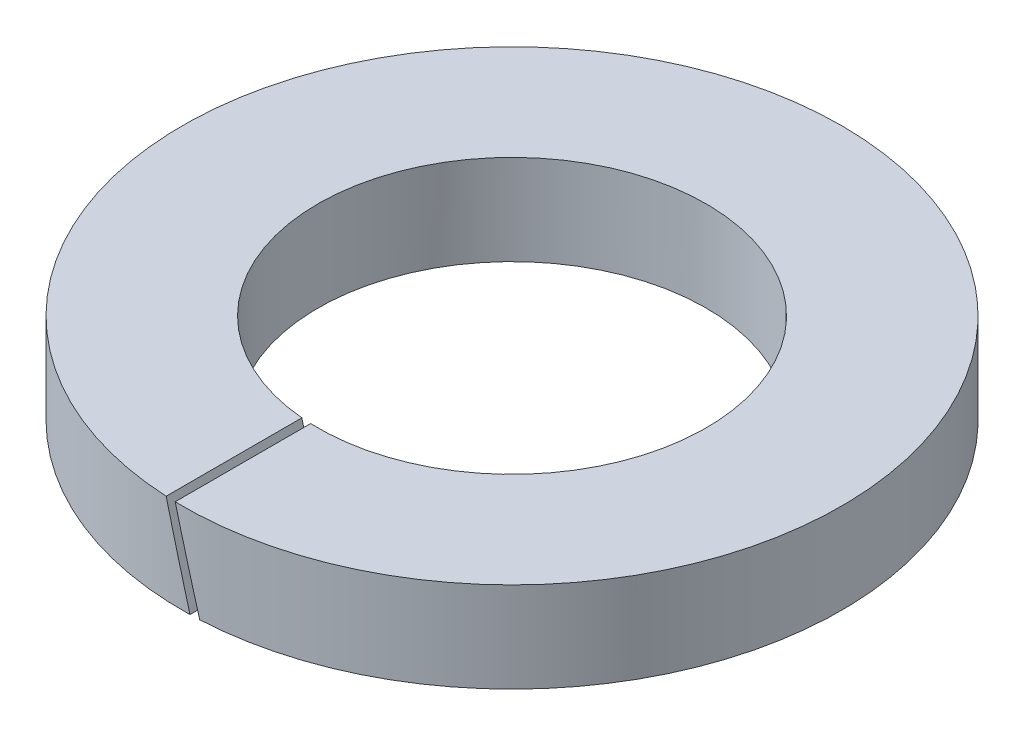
ISO-10303-21;
HEADER;
FILE_DESCRIPTION(('STEP AP214'),'2;1');
FILE_NAME('part.step','',(''),(''),'','','');
FILE_SCHEMA(('AUTOMOTIVE_DESIGN { 1 0 10303 214 1 1 1 1 }'));
ENDSEC;
DATA;
#1=APPLICATION_CONTEXT('core data for automotive mechanical design processes');
#2=APPLICATION_PROTOCOL_DEFINITION('international standard','automotive_design',2000,#1);
#3=PRODUCT_CONTEXT('',#1,'mechanical');
#4=PRODUCT('Part','Part','',(#3));
#5=PRODUCT_RELATED_PRODUCT_CATEGORY('part','',(#4));
#6=PRODUCT_DEFINITION_FORMATION('','',#4);
#7=PRODUCT_DEFINITION_CONTEXT('part definition',#1,'design');
#8=PRODUCT_DEFINITION('design','',#6,#7);
#9=PRODUCT_DEFINITION_SHAPE('','',#8);
#10=(LENGTH_UNIT() NAMED_UNIT(*) SI_UNIT(.MILLI.,.METRE.));
#11=(NAMED_UNIT(*) PLANE_ANGLE_UNIT() SI_UNIT($,.RADIAN.));
#12=(NAMED_UNIT(*) SI_UNIT($,.STERADIAN.) SOLID_ANGLE_UNIT());
#13=UNCERTAINTY_MEASURE_WITH_UNIT(LENGTH_MEASURE(1.E-05),#10,'distance_accuracy_value','');
#14=(GEOMETRIC_REPRESENTATION_CONTEXT(3) GLOBAL_UNCERTAINTY_ASSIGNED_CONTEXT((#13)) GLOBAL_UNIT_ASSIGNED_CONTEXT((#10,
#11,#12)) REPRESENTATION_CONTEXT('',''));
#15=CARTESIAN_POINT('',(0.,0.,0.));
#16=DIRECTION('',(0.,0.,1.));
#17=DIRECTION('',(1.,0.,0.));
#18=AXIS2_PLACEMENT_3D('',#15,#16,#17);
#19=CARTESIAN_POINT('',(0.,0.5,0.));
#20=DIRECTION('',(0.,1.,0.));
#21=DIRECTION('',(0.,0.,1.));
#22=AXIS2_PLACEMENT_3D('',#19,#20,#21);
#23=CYLINDRICAL_SURFACE('',#22,2.15);
#24=CARTESIAN_POINT('',(0.,0.693185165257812,0.));
#25=DIRECTION('',(-0.965925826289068,-0.258819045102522,0.));
#26=DIRECTION('',(-0.258819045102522,0.965925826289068,0.));
#27=AXIS2_PLACEMENT_3D('',#24,#25,#26);
#28=ELLIPSE('',#27,8.30696210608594,2.15);
#29=CARTESIAN_POINT('',(0.185738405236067,0.,2.14196200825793));
#30=VERTEX_POINT('',#29);
#31=CARTESIAN_POINT('',(-0.0822107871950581,1.,2.14842765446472));
#32=VERTEX_POINT('',#31);
#33=EDGE_CURVE('E47',#30,#32,#28,.T.);
#34=ORIENTED_EDGE('',*,*,#33,.T.);
#35=CARTESIAN_POINT('',(0.,1.,0.));
#36=DIRECTION('',(0.,1.,0.));
#37=DIRECTION('',(0.,0.,1.));
#38=AXIS2_PLACEMENT_3D('',#35,#36,#37);
#39=CIRCLE('',#38,2.15);
#40=CARTESIAN_POINT('',(-0.185738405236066,1.,2.14196200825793));
#41=VERTEX_POINT('',#40);
#42=EDGE_CURVE('E11',#32,#41,#39,.T.);
#43=ORIENTED_EDGE('',*,*,#42,.T.);
#44=CARTESIAN_POINT('',(0.,0.306814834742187,0.));
#45=DIRECTION('',(-0.965925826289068,-0.258819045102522,0.));
#46=DIRECTION('',(-0.258819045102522,0.965925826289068,0.));
#47=AXIS2_PLACEMENT_3D('',#44,#45,#46);
#48=ELLIPSE('',#47,8.30696210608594,2.15);
#49=CARTESIAN_POINT('',(0.0822107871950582,0.,2.14842765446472));
#50=VERTEX_POINT('',#49);
#51=EDGE_CURVE('E96',#50,#41,#48,.T.);
#52=ORIENTED_EDGE('',*,*,#51,.F.);
#53=CARTESIAN_POINT('',(0.,0.,0.));
#54=DIRECTION('',(0.,1.,0.));
#55=DIRECTION('',(0.,0.,1.));
#56=AXIS2_PLACEMENT_3D('',#53,#54,#55);
#57=CIRCLE('',#56,2.15);
#58=EDGE_CURVE('E89',#30,#50,#57,.T.);
#59=ORIENTED_EDGE('',*,*,#58,.F.);
#60=EDGE_LOOP('',(#34,#43,#52,#59));
#61=FACE_BOUND('',#60,.T.);
#62=ADVANCED_FACE('F33',(#61),#23,.F.);
#63=CARTESIAN_POINT('',(2.15,1.,0.));
#64=DIRECTION('',(0.,-1.,0.));
#65=DIRECTION('',(0.,0.,-1.));
#66=AXIS2_PLACEMENT_3D('',#63,#64,#65);
#67=PLANE('',#66);
#68=DIRECTION('',(0.,0.,1.));
#69=VECTOR('',#68,1.);
#70=CARTESIAN_POINT('',(-0.0822107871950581,1.,-3.651));
#71=LINE('',#70,#69);
#72=CARTESIAN_POINT('',(-0.0822107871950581,1.,3.64907404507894));
#73=VERTEX_POINT('',#72);
#74=EDGE_CURVE('E74',#32,#73,#71,.T.);
#75=ORIENTED_EDGE('',*,*,#74,.T.);
#76=CARTESIAN_POINT('',(0.,1.,0.));
#77=DIRECTION('',(0.,1.,0.));
#78=DIRECTION('',(0.,0.,1.));
#79=AXIS2_PLACEMENT_3D('',#76,#77,#78);
#80=CIRCLE('',#79,3.65);
#81=CARTESIAN_POINT('',(-0.185738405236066,1.,3.64527107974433));
#82=VERTEX_POINT('',#81);
#83=EDGE_CURVE('E40',#73,#82,#80,.T.);
#84=ORIENTED_EDGE('',*,*,#83,.T.);
#85=DIRECTION('',(0.,0.,1.));
#86=VECTOR('',#85,1.);
#87=CARTESIAN_POINT('',(-0.185738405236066,1.,-3.651));
#88=LINE('',#87,#86);
#89=EDGE_CURVE('E98',#41,#82,#88,.T.);
#90=ORIENTED_EDGE('',*,*,#89,.F.);
#91=ORIENTED_EDGE('',*,*,#42,.F.);
#92=EDGE_LOOP('',(#75,#84,#90,#91));
#93=FACE_BOUND('',#92,.T.);
#94=ADVANCED_FACE('F84',(#93),#67,.F.);
#95=CARTESIAN_POINT('',(0.,0.5,0.));
#96=DIRECTION('',(0.,1.,0.));
#97=DIRECTION('',(0.,0.,1.));
#98=AXIS2_PLACEMENT_3D('',#95,#96,#97);
#99=CYLINDRICAL_SURFACE('',#98,3.65);
#100=CARTESIAN_POINT('',(0.,0.693185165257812,0.));
#101=DIRECTION('',(-0.965925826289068,-0.258819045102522,0.));
#102=DIRECTION('',(-0.258819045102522,0.965925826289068,0.));
#103=AXIS2_PLACEMENT_3D('',#100,#101,#102);
#104=ELLIPSE('',#103,14.1025170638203,3.65);
#105=CARTESIAN_POINT('',(0.185738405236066,0.,3.64527107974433));
#106=VERTEX_POINT('',#105);
#107=EDGE_CURVE('E71',#73,#106,#104,.F.);
#108=ORIENTED_EDGE('',*,*,#107,.T.);
#109=CARTESIAN_POINT('',(0.,0.,0.));
#110=DIRECTION('',(0.,1.,0.));
#111=DIRECTION('',(0.,0.,1.));
#112=AXIS2_PLACEMENT_3D('',#109,#110,#111);
#113=CIRCLE('',#112,3.65);
#114=CARTESIAN_POINT('',(0.0822107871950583,0.,3.64907404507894));
#115=VERTEX_POINT('',#114);
#116=EDGE_CURVE('E88',#106,#115,#113,.T.);
#117=ORIENTED_EDGE('',*,*,#116,.T.);
#118=CARTESIAN_POINT('',(0.,0.306814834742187,0.));
#119=DIRECTION('',(-0.965925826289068,-0.258819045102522,0.));
#120=DIRECTION('',(-0.258819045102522,0.965925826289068,0.));
#121=AXIS2_PLACEMENT_3D('',#118,#119,#120);
#122=ELLIPSE('',#121,14.1025170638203,3.65);
#123=EDGE_CURVE('E55',#82,#115,#122,.F.);
#124=ORIENTED_EDGE('',*,*,#123,.F.);
#125=ORIENTED_EDGE('',*,*,#83,.F.);
#126=EDGE_LOOP('',(#108,#117,#124,#125));
#127=FACE_BOUND('',#126,.T.);
#128=ADVANCED_FACE('F87',(#127),#99,.T.);
#129=CARTESIAN_POINT('',(2.15,0.,0.));
#130=DIRECTION('',(0.,1.,0.));
#131=DIRECTION('',(0.,0.,1.));
#132=AXIS2_PLACEMENT_3D('',#129,#130,#131);
#133=PLANE('',#132);
#134=DIRECTION('',(0.,0.,-1.));
#135=VECTOR('',#134,1.);
#136=CARTESIAN_POINT('',(0.185738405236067,0.,-3.651));
#137=LINE('',#136,#135);
#138=EDGE_CURVE('E75',#106,#30,#137,.T.);
#139=ORIENTED_EDGE('',*,*,#138,.T.);
#140=ORIENTED_EDGE('',*,*,#58,.T.);
#141=DIRECTION('',(0.,0.,-1.));
#142=VECTOR('',#141,1.);
#143=CARTESIAN_POINT('',(0.0822107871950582,0.,-3.651));
#144=LINE('',#143,#142);
#145=EDGE_CURVE('E100',#115,#50,#144,.T.);
#146=ORIENTED_EDGE('',*,*,#145,.F.);
#147=ORIENTED_EDGE('',*,*,#116,.F.);
#148=EDGE_LOOP('',(#139,#140,#146,#147));
#149=FACE_BOUND('',#148,.T.);
#150=ADVANCED_FACE('F107',(#149),#133,.F.);
#151=CARTESIAN_POINT('',(-0.0482962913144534,0.487059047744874,-3.651));
#152=DIRECTION('',(-0.965925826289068,-0.258819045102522,0.));
#153=DIRECTION('',(0.258819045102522,-0.965925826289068,0.));
#154=AXIS2_PLACEMENT_3D('',#151,#152,#153);
#155=PLANE('',#154);
#156=ORIENTED_EDGE('',*,*,#51,.T.);
#157=ORIENTED_EDGE('',*,*,#89,.T.);
#158=ORIENTED_EDGE('',*,*,#123,.T.);
#159=ORIENTED_EDGE('',*,*,#145,.T.);
#160=EDGE_LOOP('',(#156,#157,#158,#159));
#161=FACE_BOUND('',#160,.T.);
#162=ADVANCED_FACE('F103',(#161),#155,.F.);
#163=CARTESIAN_POINT('',(0.0482962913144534,0.512940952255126,-3.651));
#164=DIRECTION('',(-0.965925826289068,-0.258819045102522,0.));
#165=DIRECTION('',(0.258819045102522,-0.965925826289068,0.));
#166=AXIS2_PLACEMENT_3D('',#163,#164,#165);
#167=PLANE('',#166);
#168=ORIENTED_EDGE('',*,*,#138,.F.);
#169=ORIENTED_EDGE('',*,*,#107,.F.);
#170=ORIENTED_EDGE('',*,*,#74,.F.);
#171=ORIENTED_EDGE('',*,*,#33,.F.);
#172=EDGE_LOOP('',(#168,#169,#170,#171));
#173=FACE_BOUND('',#172,.T.);
#174=ADVANCED_FACE('F73',(#173),#167,.T.);
#175=CLOSED_SHELL('',(#62,#94,#128,#150,#162,#174));
#176=MANIFOLD_SOLID_BREP('B2',#175);
#177=ADVANCED_BREP_SHAPE_REPRESENTATION('',(#18,#176),#14);
#178=SHAPE_DEFINITION_REPRESENTATION(#9,#177);
ENDSEC;
END-ISO-10303-21;
